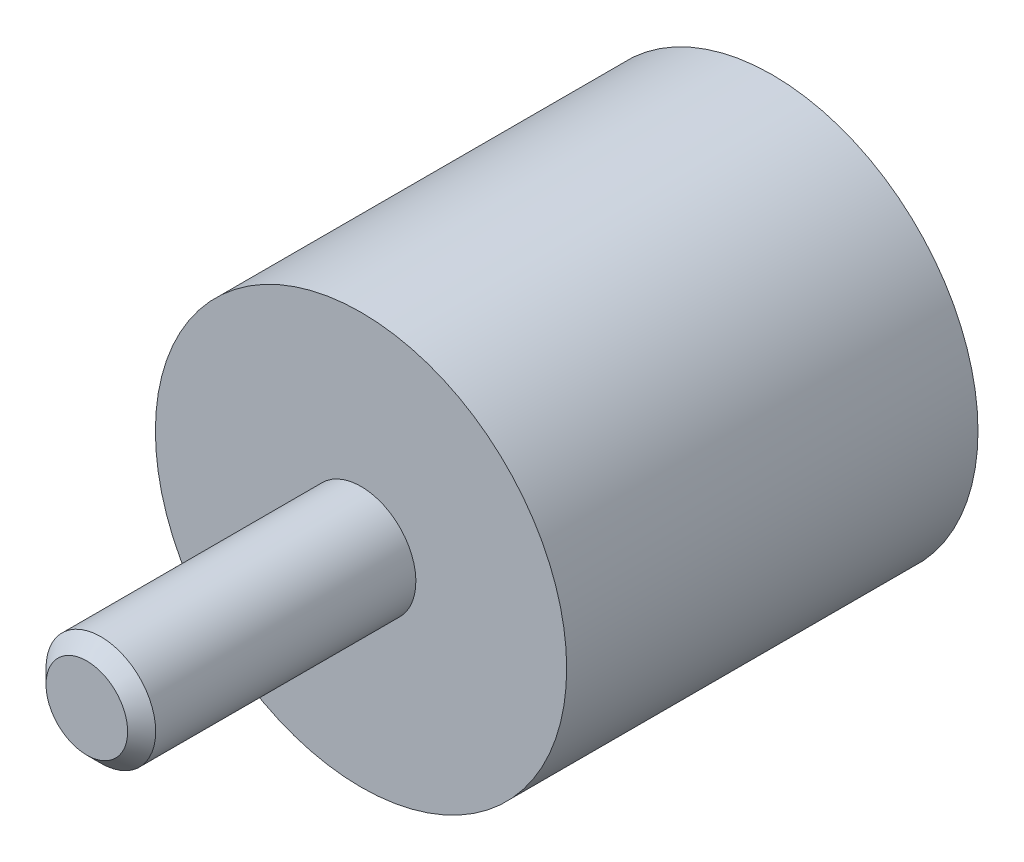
ISO-10303-21;
HEADER;
FILE_DESCRIPTION(('STEP AP214'),'2;1');
FILE_NAME('part.step','',(''),(''),'','','');
FILE_SCHEMA(('AUTOMOTIVE_DESIGN { 1 0 10303 214 1 1 1 1 }'));
ENDSEC;
DATA;
#1=APPLICATION_CONTEXT('core data for automotive mechanical design processes');
#2=APPLICATION_PROTOCOL_DEFINITION('international standard','automotive_design',2000,#1);
#3=PRODUCT_CONTEXT('',#1,'mechanical');
#4=PRODUCT('Part','Part','',(#3));
#5=PRODUCT_RELATED_PRODUCT_CATEGORY('part','',(#4));
#6=PRODUCT_DEFINITION_FORMATION('','',#4);
#7=PRODUCT_DEFINITION_CONTEXT('part definition',#1,'design');
#8=PRODUCT_DEFINITION('design','',#6,#7);
#9=PRODUCT_DEFINITION_SHAPE('','',#8);
#10=(LENGTH_UNIT() NAMED_UNIT(*) SI_UNIT(.MILLI.,.METRE.));
#11=(NAMED_UNIT(*) PLANE_ANGLE_UNIT() SI_UNIT($,.RADIAN.));
#12=(NAMED_UNIT(*) SI_UNIT($,.STERADIAN.) SOLID_ANGLE_UNIT());
#13=UNCERTAINTY_MEASURE_WITH_UNIT(LENGTH_MEASURE(1.E-05),#10,'distance_accuracy_value','');
#14=(GEOMETRIC_REPRESENTATION_CONTEXT(3) GLOBAL_UNCERTAINTY_ASSIGNED_CONTEXT((#13)) GLOBAL_UNIT_ASSIGNED_CONTEXT((#10,
#11,#12)) REPRESENTATION_CONTEXT('',''));
#15=CARTESIAN_POINT('',(0.,0.,0.));
#16=DIRECTION('',(0.,0.,1.));
#17=DIRECTION('',(1.,0.,0.));
#18=AXIS2_PLACEMENT_3D('',#15,#16,#17);
#19=CARTESIAN_POINT('',(0.,0.,0.));
#20=DIRECTION('',(0.,0.,1.));
#21=DIRECTION('',(0.,-1.,0.));
#22=AXIS2_PLACEMENT_3D('',#19,#20,#21);
#23=CYLINDRICAL_SURFACE('',#22,7.5);
#24=CARTESIAN_POINT('',(0.,0.,0.));
#25=DIRECTION('',(0.,0.,1.));
#26=DIRECTION('',(0.,-1.,0.));
#27=AXIS2_PLACEMENT_3D('',#24,#25,#26);
#28=CIRCLE('',#27,7.5);
#29=CARTESIAN_POINT('',(0.,-7.5,0.));
#30=VERTEX_POINT('',#29);
#31=EDGE_CURVE('E18',#30,#30,#28,.T.);
#32=ORIENTED_EDGE('',*,*,#31,.T.);
#33=EDGE_LOOP('',(#32));
#34=FACE_BOUND('',#33,.T.);
#35=CARTESIAN_POINT('',(0.,0.,15.));
#36=DIRECTION('',(0.,0.,-1.));
#37=DIRECTION('',(0.,1.,0.));
#38=AXIS2_PLACEMENT_3D('',#35,#36,#37);
#39=CIRCLE('',#38,7.5);
#40=CARTESIAN_POINT('',(0.,7.5,15.));
#41=VERTEX_POINT('',#40);
#42=EDGE_CURVE('E22',#41,#41,#39,.T.);
#43=ORIENTED_EDGE('',*,*,#42,.T.);
#44=EDGE_LOOP('',(#43));
#45=FACE_BOUND('',#44,.T.);
#46=ADVANCED_FACE('F12',(#34,#45),#23,.T.);
#47=CARTESIAN_POINT('',(7.5,0.,0.));
#48=DIRECTION('',(0.,0.,-1.));
#49=DIRECTION('',(0.,1.,0.));
#50=AXIS2_PLACEMENT_3D('',#47,#48,#49);
#51=PLANE('',#50);
#52=ORIENTED_EDGE('',*,*,#31,.F.);
#53=EDGE_LOOP('',(#52));
#54=FACE_BOUND('',#53,.T.);
#55=ADVANCED_FACE('F48',(#54),#51,.T.);
#56=CARTESIAN_POINT('',(7.5,0.,15.));
#57=DIRECTION('',(0.,0.,1.));
#58=DIRECTION('',(0.,-1.,0.));
#59=AXIS2_PLACEMENT_3D('',#56,#57,#58);
#60=PLANE('',#59);
#61=CARTESIAN_POINT('',(0.,0.,15.));
#62=DIRECTION('',(0.,0.,1.));
#63=DIRECTION('',(0.,-1.,0.));
#64=AXIS2_PLACEMENT_3D('',#61,#62,#63);
#65=CIRCLE('',#64,2.);
#66=CARTESIAN_POINT('',(0.,-2.,15.));
#67=VERTEX_POINT('',#66);
#68=EDGE_CURVE('E8',#67,#67,#65,.F.);
#69=ORIENTED_EDGE('',*,*,#68,.T.);
#70=EDGE_LOOP('',(#69));
#71=FACE_BOUND('',#70,.T.);
#72=ORIENTED_EDGE('',*,*,#42,.F.);
#73=EDGE_LOOP('',(#72));
#74=FACE_BOUND('',#73,.T.);
#75=ADVANCED_FACE('F52',(#71,#74),#60,.T.);
#76=CARTESIAN_POINT('',(0.,0.,10.));
#77=DIRECTION('',(0.,0.,1.));
#78=DIRECTION('',(0.,-1.,0.));
#79=AXIS2_PLACEMENT_3D('',#76,#77,#78);
#80=CYLINDRICAL_SURFACE('',#79,2.);
#81=ORIENTED_EDGE('',*,*,#68,.F.);
#82=EDGE_LOOP('',(#81));
#83=FACE_BOUND('',#82,.T.);
#84=CARTESIAN_POINT('',(0.,0.,24.4889744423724));
#85=DIRECTION('',(0.,0.,-1.));
#86=DIRECTION('',(0.,1.,0.));
#87=AXIS2_PLACEMENT_3D('',#84,#85,#86);
#88=CIRCLE('',#87,2.);
#89=CARTESIAN_POINT('',(0.,2.,24.4889744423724));
#90=VERTEX_POINT('',#89);
#91=EDGE_CURVE('E26',#90,#90,#88,.T.);
#92=ORIENTED_EDGE('',*,*,#91,.T.);
#93=EDGE_LOOP('',(#92));
#94=FACE_BOUND('',#93,.T.);
#95=ADVANCED_FACE('F45',(#83,#94),#80,.T.);
#96=CARTESIAN_POINT('',(0.,0.,24.4889744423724));
#97=DIRECTION('',(0.,0.,-1.));
#98=DIRECTION('',(0.,1.,0.));
#99=AXIS2_PLACEMENT_3D('',#96,#97,#98);
#100=CONICAL_SURFACE('',#99,2.,0.785398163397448);
#101=CARTESIAN_POINT('',(0.,0.,25.));
#102=DIRECTION('',(0.,0.,-1.));
#103=DIRECTION('',(0.,1.,0.));
#104=AXIS2_PLACEMENT_3D('',#101,#102,#103);
#105=CIRCLE('',#104,1.48897444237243);
#106=CARTESIAN_POINT('',(0.,1.48897444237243,25.));
#107=VERTEX_POINT('',#106);
#108=EDGE_CURVE('E31',#107,#107,#105,.T.);
#109=ORIENTED_EDGE('',*,*,#108,.T.);
#110=EDGE_LOOP('',(#109));
#111=FACE_BOUND('',#110,.T.);
#112=ORIENTED_EDGE('',*,*,#91,.F.);
#113=EDGE_LOOP('',(#112));
#114=FACE_BOUND('',#113,.T.);
#115=ADVANCED_FACE('F35',(#111,#114),#100,.T.);
#116=CARTESIAN_POINT('',(1.48897444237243,0.,25.));
#117=DIRECTION('',(0.,0.,1.));
#118=DIRECTION('',(0.,-1.,0.));
#119=AXIS2_PLACEMENT_3D('',#116,#117,#118);
#120=PLANE('',#119);
#121=ORIENTED_EDGE('',*,*,#108,.F.);
#122=EDGE_LOOP('',(#121));
#123=FACE_BOUND('',#122,.T.);
#124=ADVANCED_FACE('F38',(#123),#120,.T.);
#125=CLOSED_SHELL('',(#46,#55,#75,#95,#115,#124));
#126=MANIFOLD_SOLID_BREP('B1',#125);
#127=ADVANCED_BREP_SHAPE_REPRESENTATION('',(#18,#126),#14);
#128=SHAPE_DEFINITION_REPRESENTATION(#9,#127);
ENDSEC;
END-ISO-10303-21;
